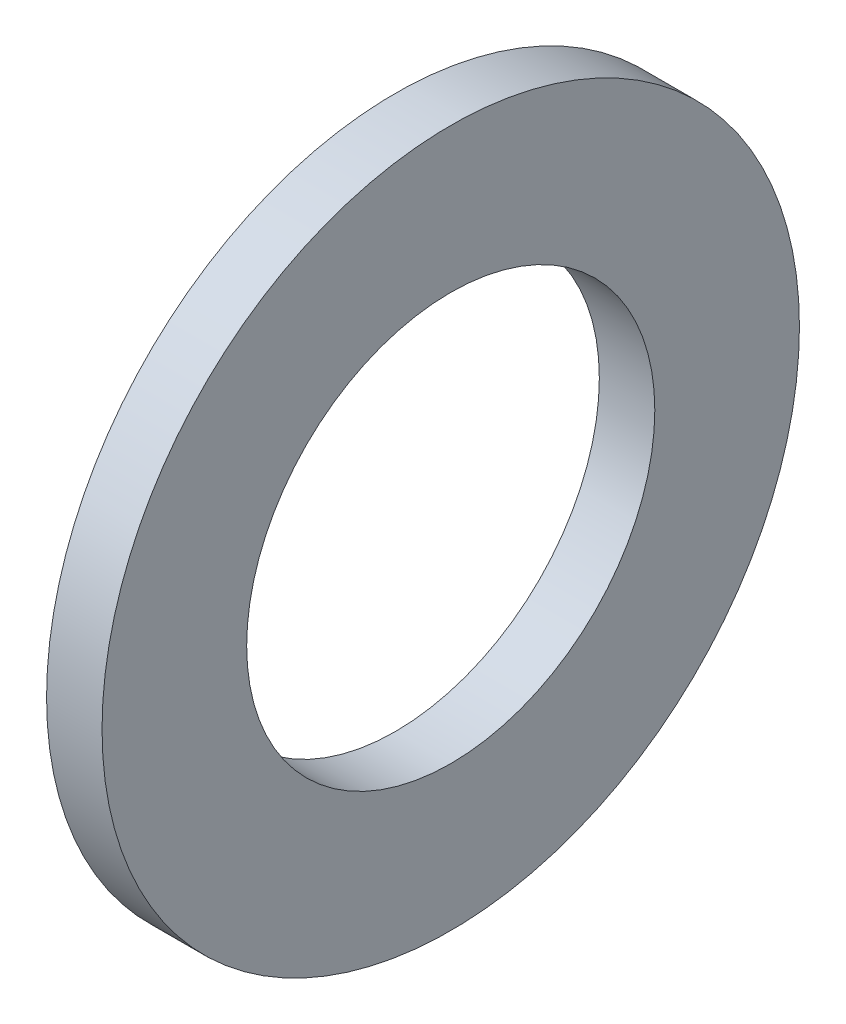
from build123d import *

# Parameters (mm, degrees)
SKETCH1_R           = 11.176
SKETCH1_R_2         = 6.5405
BOSS_EXTRUDE1_DEPTH = 1.778


with BuildPart() as part:
    # Sketch1 → Boss-Extrude1 (new body)
    with BuildSketch(Plane(origin=(0, 0, 0), x_dir=(0, 0, -1), z_dir=(1, 0, 0))):
        Circle(SKETCH1_R)
        Circle(SKETCH1_R_2, mode=Mode.SUBTRACT)
    extrude(amount=BOSS_EXTRUDE1_DEPTH)


solid = part.part
